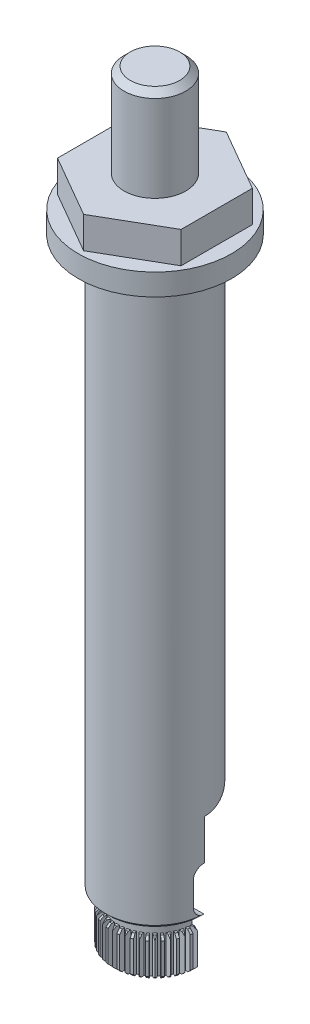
from build123d import *

# Parameters (mm, degrees)
CHANFREIN2_SIZE              = 0.5
ENL_V_MAT_EXTRU_7_DEPTH      = 6
R_P_TITION_CIRCULAIRE1_COUNT = 24
EXTRUSION2_DEPTH             = 5.1
TROU_TARAUD_M6_D             = 5
TROU_TARAUD_M6_DEPTH         = 20
TROU_TARAUD_M6_CBORE_D       = 6
TROU_TARAUD_M6_CBORE_DEPTH   = 16
TROU_TARAUD_M6_TIP           = 1.502151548
ENL_V_MAT_EXTRU_6_DEPTH      = 20
ESQUISSE26_R                 = 5
EXTRUSION3_DEPTH             = 15
CHANFREIN3_SIZE              = 1
ENL_V_MAT_EXTRU_8_DEPTH      = 16


with BuildPart() as part:
    # Esquisse1 → R_volution1 (revolve)
    with BuildSketch(Plane.XY, mode=Mode.PRIVATE) as r_volution1_sk:
        Polygon((0, 108.3), (-10, 108.3), (-10, 103.2), (-12.4, 103.2), (-12.4, 99.7), (-8, 99.7), (-8, 8), (-6, 8), (-6, 6), (-6.9, 6), (-6.9, 0), (0, 0), align=None)
    revolve(r_volution1_sk.sketch.rotate(Axis((0, 83.489858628, 0), (0, -1, 0)), 270), axis=Axis((0, 83.489858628, 0), (0, -1, 0)))

    # Chanfrein2
    chanfrein2_edges = [part.edges().sort_by_distance(p)[0] for p in [
        (0, 0, -6.9),
        (0, 6, -6.9),
        (0, 8, -8),
    ]]
    chamfer(chanfrein2_edges, length=CHANFREIN2_SIZE)

    # Esquisse21 → Enl_v. mat.-Extru.7 (cut)
    with BuildSketch(Plane.XZ):
        with BuildLine():
            Line((0, 6.9), (-0.291938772, 5.992893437))
            ThreePointArc((-0.291938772, 5.992893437), (-0.449815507, 5.983115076), (-0.60737961, 5.969178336))
            Line((-0.60737961, 5.969178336), (-0.730842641, 7.182542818))
            Line((-0.730842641, 7.182542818), (0.730842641, 7.182542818))
            Line((0.730842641, 7.182542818), (0.60737961, 5.969178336))
            ThreePointArc((0.60737961, 5.969178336), (0.449815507, 5.983115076), (0.291938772, 5.992893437))
            Line((0.291938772, 5.992893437), (0, 6.9))
        make_face()
    enl_v_mat_extru_7 = extrude(amount=-ENL_V_MAT_EXTRU_7_DEPTH, mode=Mode.SUBTRACT)

    # R_p_tition circulaire1: Enl_v. mat.-Extru.7 ×24 about axis
    r_p_tition_circulaire1_axis = Axis((0, 0, 0), (0, 1, 0))
    for i in range(1, R_P_TITION_CIRCULAIRE1_COUNT):
        add(enl_v_mat_extru_7.rotate(r_p_tition_circulaire1_axis, i * 360 / R_P_TITION_CIRCULAIRE1_COUNT), mode=Mode.SUBTRACT)

    # Esquisse10 → Extrusion2 (add)
    with BuildSketch(Plane(origin=(0, 108.3, 0), x_dir=(-1, 0, 0), z_dir=(0, 1, 0))):
        Polygon((0, 11.547005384), (-10, 5.773502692), (-10, -5.773502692), (0, -11.547005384), (10, -5.773502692), (10, 5.773502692), align=None)
    extrude(amount=-EXTRUSION2_DEPTH)

    # Trou taraud_ M6
    with Locations(Plane(origin=(0, 0, 0), x_dir=(0, 0, -1), z_dir=(0, -1, 0))):
        with Locations((0, 0)):
            CounterBoreHole(TROU_TARAUD_M6_D / 2, TROU_TARAUD_M6_CBORE_D / 2, TROU_TARAUD_M6_CBORE_DEPTH, depth=TROU_TARAUD_M6_DEPTH)
            with Locations((0, 0, -(TROU_TARAUD_M6_DEPTH + TROU_TARAUD_M6_TIP / 2))):  # 118° drill point
                Cone(0, TROU_TARAUD_M6_D / 2, TROU_TARAUD_M6_TIP, mode=Mode.SUBTRACT)

    # Esquisse20 → Enl_v. mat.-Extru.6 (cut, symmetric)
    with BuildSketch(Plane(origin=(0, 0, 0), x_dir=(0, 0, -1), z_dir=(1, 0, 0))):
        with BuildLine():
            Line((-1.6, 14), (-1.6, 10))
            ThreePointArc((-1.6, 10), (0, 8.4), (1.6, 10))
            Line((1.6, 10), (1.6, 14))
            ThreePointArc((1.6, 14), (0, 15.6), (-1.6, 14))
        make_face()
    extrude(amount=ENL_V_MAT_EXTRU_6_DEPTH, both=True, mode=Mode.SUBTRACT)

    # Esquisse26 → Extrusion3 (add)
    with BuildSketch(Plane(origin=(0, 108.3, 0), x_dir=(1, 0, 0), z_dir=(0, 1, 0))):
        with Locations(Location((0, 0, 0), (0, 0, 270))):
            Circle(ESQUISSE26_R)
    extrude(amount=EXTRUSION3_DEPTH)

    # Chanfrein3
    chanfrein3_edges = [part.edges().sort_by_distance(p)[0] for p in [
        (0, 123.3, -5),
    ]]
    chamfer(chanfrein3_edges, length=CHANFREIN3_SIZE)

    # Esquisse27 → Enl_v. mat.-Extru.8 (cut)
    with BuildSketch(Plane.XY):
        with BuildLine():
            add(Edge.make_bspline(
                [(-8, 21.589822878), (-7.09065669, 22.631828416), (-5.34292561, 24.335483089), (-0.688127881, 22.982021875), (4.024296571, 24.226295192), (15.319942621, 18.77667272), (14.776710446, -9.236461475), (-20.515778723, -4.91173122), (-13.684965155, 15.075489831), (-8, 21.589822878)],
                knots=[0, 0, 0, 0, 0.043088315, 0.078256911, 0.155054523, 0.206086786, 0.491010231, 0.730623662, 1, 1, 1, 1], degree=3))
        make_face()
    extrude(amount=-ENL_V_MAT_EXTRU_8_DEPTH, mode=Mode.SUBTRACT)


solid = part.part
